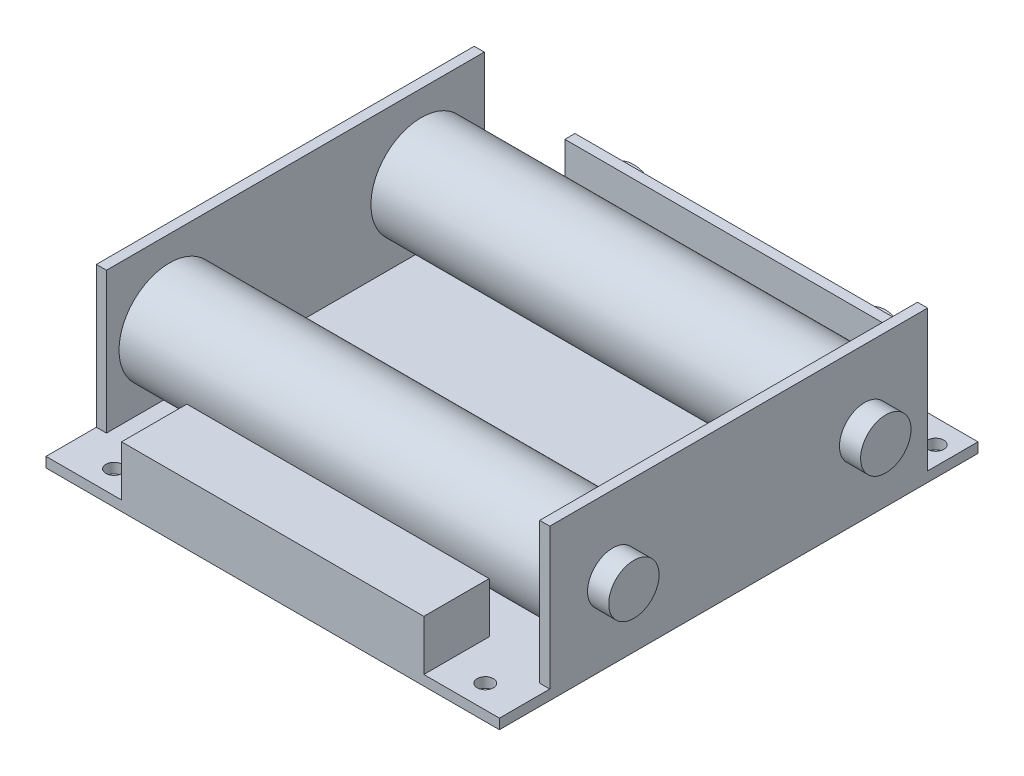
from build123d import *

# Parameters (mm, degrees)
SKETCH1_W                  = 90
SKETCH1_H                  = 95
BOSS_EXTRUDE1_DEPTH        = 2
F_3_2_3_2_DIAMETER_HOLE1_D = 3.2
SKETCH4_W                  = 75
SKETCH4_H                  = 30
BOSS_EXTRUDE2_DEPTH        = 2
BOSS_EXTRUDE3_DEPTH        = 4.2
BOSS_EXTRUDE3_DEPTH_BACK   = 94.2
SKETCH5_R                  = 5
SKETCH6_W                  = 60
SKETCH6_H                  = 13
BOSS_EXTRUDE4_DEPTH        = 10
SKETCH7_W                  = 70
SKETCH7_H                  = 15
BOSS_EXTRUDE5_DEPTH        = 2
SKETCH8_R                  = 5
BOSS_EXTRUDE6_DEPTH        = 4.2


with BuildPart() as part:
    # Sketch1 → Boss-Extrude1 (new body)
    with BuildSketch(Plane(origin=(0, 0, 0), x_dir=(1, 0, 0), z_dir=(0, 1, 0))):
        Rectangle(SKETCH1_W, SKETCH1_H)
    extrude(amount=BOSS_EXTRUDE1_DEPTH)

    # 3.2 _3.2_ Diameter Hole1 (through all)
    with Locations(Plane(origin=(0, 0, 0), x_dir=(-1, 0, 0), z_dir=(0, -1, 0))):
        with Locations((36.1, -42.9), (-37.6, -42.9), (-41.3, 42.8), (38.7, 42.8)):
            Hole(F_3_2_3_2_DIAMETER_HOLE1_D / 2)

    # Sketch4 → Boss-Extrude2 (add)
    with BuildSketch(Plane(origin=(45, 0, 0), x_dir=(0, 0, -1), z_dir=(1, 0, 0))):
        with Locations((0, 15)):
            Rectangle(SKETCH4_W, SKETCH4_H)
    boss_extrude2 = extrude(amount=-BOSS_EXTRUDE2_DEPTH)

    # Mirror1: Boss-Extrude2 across plane
    add(boss_extrude2.mirror(Plane(origin=(0, 0, 0), x_dir=(0, 0, 1), z_dir=(1, 0, 0))))

    # Sketch5 → Boss-Extrude3 (add, two sides: drawn at the far end of the back side and taken through both)
    with BuildSketch(Plane(origin=(45, 0, 0), x_dir=(0, 0, -1), z_dir=(1, 0, 0)).offset(-BOSS_EXTRUDE3_DEPTH_BACK)):
        with Locations((-25, 15)):
            Circle(SKETCH5_R)
        with Locations((25, 15)):
            Circle(SKETCH5_R)
    extrude(amount=BOSS_EXTRUDE3_DEPTH + BOSS_EXTRUDE3_DEPTH_BACK)

    # Sketch6 → Boss-Extrude4 (add)
    with BuildSketch(Plane(origin=(0, 2, 0), x_dir=(1, 0, 0), z_dir=(0, 1, 0))):
        with Locations((0, -41)):
            Rectangle(SKETCH6_W, SKETCH6_H)
    extrude(amount=BOSS_EXTRUDE4_DEPTH)

    # Sketch7 → Boss-Extrude5 (add)
    with BuildSketch(Plane(origin=(0, 0, -47.5), x_dir=(-1, 0, 0), z_dir=(0, 0, -1))):
        with Locations((0, 7.5)):
            Rectangle(SKETCH7_W, SKETCH7_H)
    extrude(amount=-BOSS_EXTRUDE5_DEPTH)

    # Sketch8 → Boss-Extrude6 (add)
    with BuildSketch(Plane(origin=(0, 0, -47.5), x_dir=(-1, 0, 0), z_dir=(0, 0, -1))):
        with Locations(Location((-22.45, 6.3, 0), (0, 0, 180))):
            Circle(SKETCH8_R)
        with Locations(Location((27.55, 6.3, 0), (0, 0, 180))):
            Circle(SKETCH8_R)
    extrude(amount=BOSS_EXTRUDE6_DEPTH)


solid = part.part
